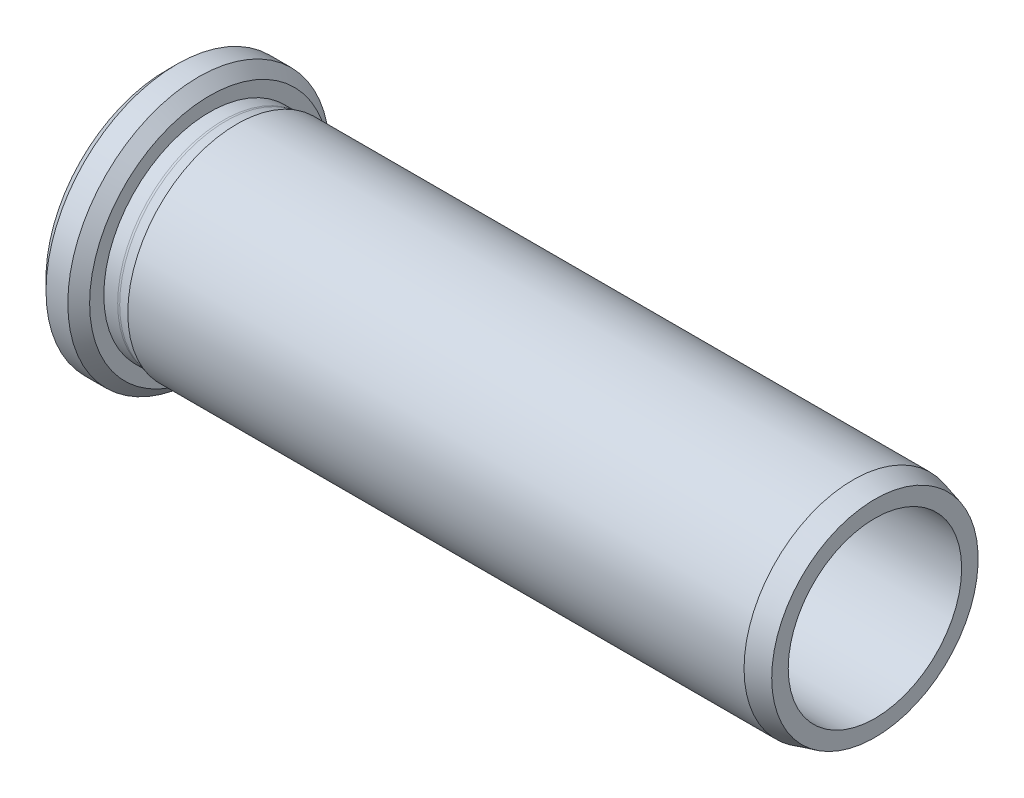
ISO-10303-21;
HEADER;
FILE_DESCRIPTION(('STEP AP214'),'2;1');
FILE_NAME('part.step','',(''),(''),'','','');
FILE_SCHEMA(('AUTOMOTIVE_DESIGN { 1 0 10303 214 1 1 1 1 }'));
ENDSEC;
DATA;
#1=APPLICATION_CONTEXT('core data for automotive mechanical design processes');
#2=APPLICATION_PROTOCOL_DEFINITION('international standard','automotive_design',2000,#1);
#3=PRODUCT_CONTEXT('',#1,'mechanical');
#4=PRODUCT('Part','Part','',(#3));
#5=PRODUCT_RELATED_PRODUCT_CATEGORY('part','',(#4));
#6=PRODUCT_DEFINITION_FORMATION('','',#4);
#7=PRODUCT_DEFINITION_CONTEXT('part definition',#1,'design');
#8=PRODUCT_DEFINITION('design','',#6,#7);
#9=PRODUCT_DEFINITION_SHAPE('','',#8);
#10=(LENGTH_UNIT() NAMED_UNIT(*) SI_UNIT(.MILLI.,.METRE.));
#11=(NAMED_UNIT(*) PLANE_ANGLE_UNIT() SI_UNIT($,.RADIAN.));
#12=(NAMED_UNIT(*) SI_UNIT($,.STERADIAN.) SOLID_ANGLE_UNIT());
#13=UNCERTAINTY_MEASURE_WITH_UNIT(LENGTH_MEASURE(1.E-05),#10,'distance_accuracy_value','');
#14=(GEOMETRIC_REPRESENTATION_CONTEXT(3) GLOBAL_UNCERTAINTY_ASSIGNED_CONTEXT((#13)) GLOBAL_UNIT_ASSIGNED_CONTEXT((#10,
#11,#12)) REPRESENTATION_CONTEXT('',''));
#15=CARTESIAN_POINT('',(0.,0.,0.));
#16=DIRECTION('',(0.,0.,1.));
#17=DIRECTION('',(1.,0.,0.));
#18=AXIS2_PLACEMENT_3D('',#15,#16,#17);
#19=CARTESIAN_POINT('',(30.8004766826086,7.95,0.));
#20=DIRECTION('',(1.,0.,0.));
#21=DIRECTION('',(0.,0.,-1.));
#22=AXIS2_PLACEMENT_3D('',#19,#20,#21);
#23=PLANE('',#22);
#24=CARTESIAN_POINT('',(30.8004766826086,0.,0.));
#25=DIRECTION('',(-1.,0.,0.));
#26=DIRECTION('',(0.,0.,1.));
#27=AXIS2_PLACEMENT_3D('',#24,#25,#26);
#28=CIRCLE('',#27,7.95);
#29=CARTESIAN_POINT('',(30.8004766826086,0.,7.95));
#30=VERTEX_POINT('',#29);
#31=EDGE_CURVE('E64',#30,#30,#28,.T.);
#32=ORIENTED_EDGE('',*,*,#31,.F.);
#33=EDGE_LOOP('',(#32));
#34=FACE_BOUND('',#33,.T.);
#35=CARTESIAN_POINT('',(30.8004766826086,0.,0.));
#36=DIRECTION('',(-1.,0.,0.));
#37=DIRECTION('',(0.,0.,1.));
#38=AXIS2_PLACEMENT_3D('',#35,#36,#37);
#39=CIRCLE('',#38,8.);
#40=CARTESIAN_POINT('',(30.8004766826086,0.,8.));
#41=VERTEX_POINT('',#40);
#42=EDGE_CURVE('E40',#41,#41,#39,.T.);
#43=ORIENTED_EDGE('',*,*,#42,.T.);
#44=EDGE_LOOP('',(#43));
#45=FACE_BOUND('',#44,.T.);
#46=ADVANCED_FACE('F14',(#34,#45),#23,.F.);
#47=CARTESIAN_POINT('',(0.,0.,0.));
#48=DIRECTION('',(-1.,0.,0.));
#49=DIRECTION('',(0.,0.,1.));
#50=AXIS2_PLACEMENT_3D('',#47,#48,#49);
#51=CYLINDRICAL_SURFACE('',#50,8.);
#52=CARTESIAN_POINT('',(12.3004766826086,0.,0.));
#53=DIRECTION('',(1.,0.,0.));
#54=DIRECTION('',(0.,0.,-1.));
#55=AXIS2_PLACEMENT_3D('',#52,#53,#54);
#56=CIRCLE('',#55,8.);
#57=CARTESIAN_POINT('',(12.3004766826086,0.,-8.));
#58=VERTEX_POINT('',#57);
#59=EDGE_CURVE('E29',#58,#58,#56,.F.);
#60=ORIENTED_EDGE('',*,*,#59,.T.);
#61=EDGE_LOOP('',(#60));
#62=FACE_BOUND('',#61,.T.);
#63=ORIENTED_EDGE('',*,*,#42,.F.);
#64=EDGE_LOOP('',(#63));
#65=FACE_BOUND('',#64,.T.);
#66=ADVANCED_FACE('F72',(#62,#65),#51,.F.);
#67=CARTESIAN_POINT('',(10.8004766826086,12.,0.));
#68=DIRECTION('',(1.,0.,0.));
#69=DIRECTION('',(0.,0.,-1.));
#70=AXIS2_PLACEMENT_3D('',#67,#68,#69);
#71=PLANE('',#70);
#72=CARTESIAN_POINT('',(10.8004766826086,0.,0.));
#73=DIRECTION('',(1.,0.,0.));
#74=DIRECTION('',(0.,0.,-1.));
#75=AXIS2_PLACEMENT_3D('',#72,#73,#74);
#76=CIRCLE('',#75,9.5);
#77=CARTESIAN_POINT('',(10.8004766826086,0.,-9.5));
#78=VERTEX_POINT('',#77);
#79=EDGE_CURVE('E25',#78,#78,#76,.T.);
#80=ORIENTED_EDGE('',*,*,#79,.T.);
#81=EDGE_LOOP('',(#80));
#82=FACE_BOUND('',#81,.T.);
#83=CARTESIAN_POINT('',(10.8004766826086,0.,0.));
#84=DIRECTION('',(1.,0.,0.));
#85=DIRECTION('',(0.,0.,-1.));
#86=AXIS2_PLACEMENT_3D('',#83,#84,#85);
#87=CIRCLE('',#86,11.);
#88=CARTESIAN_POINT('',(10.8004766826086,0.,-11.));
#89=VERTEX_POINT('',#88);
#90=EDGE_CURVE('E37',#89,#89,#87,.F.);
#91=ORIENTED_EDGE('',*,*,#90,.T.);
#92=EDGE_LOOP('',(#91));
#93=FACE_BOUND('',#92,.T.);
#94=ADVANCED_FACE('F77',(#82,#93),#71,.F.);
#95=CARTESIAN_POINT('',(0.,0.,0.));
#96=DIRECTION('',(-1.,0.,0.));
#97=DIRECTION('',(0.,0.,1.));
#98=AXIS2_PLACEMENT_3D('',#95,#96,#97);
#99=CYLINDRICAL_SURFACE('',#98,12.);
#100=CARTESIAN_POINT('',(13.8004766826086,0.,0.));
#101=DIRECTION('',(-1.,0.,0.));
#102=DIRECTION('',(0.,0.,1.));
#103=AXIS2_PLACEMENT_3D('',#100,#101,#102);
#104=CIRCLE('',#103,12.);
#105=CARTESIAN_POINT('',(13.8004766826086,0.,12.));
#106=VERTEX_POINT('',#105);
#107=EDGE_CURVE('E21',#106,#106,#104,.T.);
#108=ORIENTED_EDGE('',*,*,#107,.T.);
#109=EDGE_LOOP('',(#108));
#110=FACE_BOUND('',#109,.T.);
#111=CARTESIAN_POINT('',(11.8004766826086,0.,0.));
#112=DIRECTION('',(1.,0.,0.));
#113=DIRECTION('',(0.,0.,-1.));
#114=AXIS2_PLACEMENT_3D('',#111,#112,#113);
#115=CIRCLE('',#114,12.);
#116=CARTESIAN_POINT('',(11.8004766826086,0.,-12.));
#117=VERTEX_POINT('',#116);
#118=EDGE_CURVE('E34',#117,#117,#115,.T.);
#119=ORIENTED_EDGE('',*,*,#118,.T.);
#120=EDGE_LOOP('',(#119));
#121=FACE_BOUND('',#120,.T.);
#122=ADVANCED_FACE('F85',(#110,#121),#99,.T.);
#123=CARTESIAN_POINT('',(14.8004766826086,12.,0.));
#124=DIRECTION('',(-1.,0.,0.));
#125=DIRECTION('',(0.,0.,1.));
#126=AXIS2_PLACEMENT_3D('',#123,#124,#125);
#127=PLANE('',#126);
#128=CARTESIAN_POINT('',(14.8004766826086,0.,0.));
#129=DIRECTION('',(-1.,0.,0.));
#130=DIRECTION('',(0.,0.,1.));
#131=AXIS2_PLACEMENT_3D('',#128,#129,#130);
#132=CIRCLE('',#131,11.);
#133=CARTESIAN_POINT('',(14.8004766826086,0.,11.));
#134=VERTEX_POINT('',#133);
#135=EDGE_CURVE('E9',#134,#134,#132,.F.);
#136=ORIENTED_EDGE('',*,*,#135,.T.);
#137=EDGE_LOOP('',(#136));
#138=FACE_BOUND('',#137,.T.);
#139=CARTESIAN_POINT('',(14.8004766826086,0.,0.));
#140=DIRECTION('',(-1.,0.,0.));
#141=DIRECTION('',(0.,0.,1.));
#142=AXIS2_PLACEMENT_3D('',#139,#140,#141);
#143=CIRCLE('',#142,9.7);
#144=CARTESIAN_POINT('',(14.8004766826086,0.,9.7));
#145=VERTEX_POINT('',#144);
#146=EDGE_CURVE('E43',#145,#145,#143,.T.);
#147=ORIENTED_EDGE('',*,*,#146,.T.);
#148=EDGE_LOOP('',(#147));
#149=FACE_BOUND('',#148,.T.);
#150=ADVANCED_FACE('F124',(#138,#149),#127,.F.);
#151=CARTESIAN_POINT('',(0.,0.,0.));
#152=DIRECTION('',(-1.,0.,0.));
#153=DIRECTION('',(0.,0.,1.));
#154=AXIS2_PLACEMENT_3D('',#151,#152,#153);
#155=CYLINDRICAL_SURFACE('',#154,9.7);
#156=ORIENTED_EDGE('',*,*,#146,.F.);
#157=EDGE_LOOP('',(#156));
#158=FACE_BOUND('',#157,.T.);
#159=CARTESIAN_POINT('',(16.075539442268,0.,0.));
#160=DIRECTION('',(-1.,0.,0.));
#161=DIRECTION('',(0.,0.,1.));
#162=AXIS2_PLACEMENT_3D('',#159,#160,#161);
#163=CIRCLE('',#162,9.7);
#164=CARTESIAN_POINT('',(16.075539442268,0.,9.7));
#165=VERTEX_POINT('',#164);
#166=EDGE_CURVE('E46',#165,#165,#163,.T.);
#167=ORIENTED_EDGE('',*,*,#166,.T.);
#168=EDGE_LOOP('',(#167));
#169=FACE_BOUND('',#168,.T.);
#170=ADVANCED_FACE('F129',(#158,#169),#155,.T.);
#171=CARTESIAN_POINT('',(16.075539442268,0.,0.));
#172=DIRECTION('',(-1.,0.,0.));
#173=DIRECTION('',(0.,0.,1.));
#174=AXIS2_PLACEMENT_3D('',#171,#172,#173);
#175=TOROIDAL_SURFACE('',#174,10.5,0.8);
#176=ORIENTED_EDGE('',*,*,#166,.F.);
#177=EDGE_LOOP('',(#176));
#178=FACE_BOUND('',#177,.T.);
#179=CARTESIAN_POINT('',(16.2825946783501,0.,0.));
#180=DIRECTION('',(-1.,0.,0.));
#181=DIRECTION('',(0.,0.,1.));
#182=AXIS2_PLACEMENT_3D('',#179,#180,#181);
#183=CIRCLE('',#182,9.72725933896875);
#184=CARTESIAN_POINT('',(16.2825946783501,0.,9.72725933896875));
#185=VERTEX_POINT('',#184);
#186=EDGE_CURVE('E49',#185,#185,#183,.T.);
#187=ORIENTED_EDGE('',*,*,#186,.T.);
#188=EDGE_LOOP('',(#187));
#189=FACE_BOUND('',#188,.T.);
#190=ADVANCED_FACE('F189',(#178,#189),#175,.F.);
#191=CARTESIAN_POINT('',(17.3004766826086,0.,0.));
#192=DIRECTION('',(1.,0.,0.));
#193=DIRECTION('',(0.,0.,-1.));
#194=AXIS2_PLACEMENT_3D('',#191,#192,#193);
#195=CONICAL_SURFACE('',#194,10.,0.261799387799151);
#196=ORIENTED_EDGE('',*,*,#186,.F.);
#197=EDGE_LOOP('',(#196));
#198=FACE_BOUND('',#197,.T.);
#199=CARTESIAN_POINT('',(17.3004766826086,0.,0.));
#200=DIRECTION('',(-1.,0.,0.));
#201=DIRECTION('',(0.,0.,1.));
#202=AXIS2_PLACEMENT_3D('',#199,#200,#201);
#203=CIRCLE('',#202,10.);
#204=CARTESIAN_POINT('',(17.3004766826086,0.,10.));
#205=VERTEX_POINT('',#204);
#206=EDGE_CURVE('E52',#205,#205,#203,.T.);
#207=ORIENTED_EDGE('',*,*,#206,.T.);
#208=EDGE_LOOP('',(#207));
#209=FACE_BOUND('',#208,.T.);
#210=ADVANCED_FACE('F179',(#198,#209),#195,.T.);
#211=CARTESIAN_POINT('',(0.,0.,0.));
#212=DIRECTION('',(-1.,0.,0.));
#213=DIRECTION('',(0.,0.,1.));
#214=AXIS2_PLACEMENT_3D('',#211,#212,#213);
#215=CYLINDRICAL_SURFACE('',#214,10.);
#216=ORIENTED_EDGE('',*,*,#206,.F.);
#217=EDGE_LOOP('',(#216));
#218=FACE_BOUND('',#217,.T.);
#219=CARTESIAN_POINT('',(73.8004766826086,0.,0.));
#220=DIRECTION('',(-1.,0.,0.));
#221=DIRECTION('',(0.,0.,1.));
#222=AXIS2_PLACEMENT_3D('',#219,#220,#221);
#223=CIRCLE('',#222,10.);
#224=CARTESIAN_POINT('',(73.8004766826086,0.,10.));
#225=VERTEX_POINT('',#224);
#226=EDGE_CURVE('E55',#225,#225,#223,.T.);
#227=ORIENTED_EDGE('',*,*,#226,.T.);
#228=EDGE_LOOP('',(#227));
#229=FACE_BOUND('',#228,.T.);
#230=ADVANCED_FACE('F169',(#218,#229),#215,.T.);
#231=CARTESIAN_POINT('',(75.8004766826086,0.,0.));
#232=DIRECTION('',(-1.,0.,0.));
#233=DIRECTION('',(0.,0.,1.));
#234=AXIS2_PLACEMENT_3D('',#231,#232,#233);
#235=CONICAL_SURFACE('',#234,9.46410161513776,0.261799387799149);
#236=ORIENTED_EDGE('',*,*,#226,.F.);
#237=EDGE_LOOP('',(#236));
#238=FACE_BOUND('',#237,.T.);
#239=CARTESIAN_POINT('',(75.8004766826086,0.,0.));
#240=DIRECTION('',(-1.,0.,0.));
#241=DIRECTION('',(0.,0.,1.));
#242=AXIS2_PLACEMENT_3D('',#239,#240,#241);
#243=CIRCLE('',#242,9.46410161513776);
#244=CARTESIAN_POINT('',(75.8004766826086,0.,9.46410161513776));
#245=VERTEX_POINT('',#244);
#246=EDGE_CURVE('E58',#245,#245,#243,.T.);
#247=ORIENTED_EDGE('',*,*,#246,.T.);
#248=EDGE_LOOP('',(#247));
#249=FACE_BOUND('',#248,.T.);
#250=ADVANCED_FACE('F159',(#238,#249),#235,.T.);
#251=CARTESIAN_POINT('',(75.8004766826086,9.46410161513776,0.));
#252=DIRECTION('',(-1.,0.,0.));
#253=DIRECTION('',(0.,0.,1.));
#254=AXIS2_PLACEMENT_3D('',#251,#252,#253);
#255=PLANE('',#254);
#256=ORIENTED_EDGE('',*,*,#246,.F.);
#257=EDGE_LOOP('',(#256));
#258=FACE_BOUND('',#257,.T.);
#259=CARTESIAN_POINT('',(75.8004766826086,0.,0.));
#260=DIRECTION('',(-1.,0.,0.));
#261=DIRECTION('',(0.,0.,1.));
#262=AXIS2_PLACEMENT_3D('',#259,#260,#261);
#263=CIRCLE('',#262,7.95);
#264=CARTESIAN_POINT('',(75.8004766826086,0.,7.95));
#265=VERTEX_POINT('',#264);
#266=EDGE_CURVE('E61',#265,#265,#263,.T.);
#267=ORIENTED_EDGE('',*,*,#266,.T.);
#268=EDGE_LOOP('',(#267));
#269=FACE_BOUND('',#268,.T.);
#270=ADVANCED_FACE('F148',(#258,#269),#255,.F.);
#271=CARTESIAN_POINT('',(0.,0.,0.));
#272=DIRECTION('',(-1.,0.,0.));
#273=DIRECTION('',(0.,0.,1.));
#274=AXIS2_PLACEMENT_3D('',#271,#272,#273);
#275=CYLINDRICAL_SURFACE('',#274,7.95);
#276=ORIENTED_EDGE('',*,*,#266,.F.);
#277=EDGE_LOOP('',(#276));
#278=FACE_BOUND('',#277,.T.);
#279=ORIENTED_EDGE('',*,*,#31,.T.);
#280=EDGE_LOOP('',(#279));
#281=FACE_BOUND('',#280,.T.);
#282=ADVANCED_FACE('F68',(#278,#281),#275,.F.);
#283=CARTESIAN_POINT('',(10.8004766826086,0.,0.));
#284=DIRECTION('',(1.,0.,0.));
#285=DIRECTION('',(0.,0.,-1.));
#286=AXIS2_PLACEMENT_3D('',#283,#284,#285);
#287=CONICAL_SURFACE('',#286,11.,0.785398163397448);
#288=ORIENTED_EDGE('',*,*,#118,.F.);
#289=EDGE_LOOP('',(#288));
#290=FACE_BOUND('',#289,.T.);
#291=ORIENTED_EDGE('',*,*,#90,.F.);
#292=EDGE_LOOP('',(#291));
#293=FACE_BOUND('',#292,.T.);
#294=ADVANCED_FACE('F90',(#290,#293),#287,.T.);
#295=CARTESIAN_POINT('',(12.3004766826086,0.,0.));
#296=DIRECTION('',(1.,0.,0.));
#297=DIRECTION('',(0.,0.,-1.));
#298=AXIS2_PLACEMENT_3D('',#295,#296,#297);
#299=TOROIDAL_SURFACE('',#298,9.5,1.5);
#300=ORIENTED_EDGE('',*,*,#79,.F.);
#301=EDGE_LOOP('',(#300));
#302=FACE_BOUND('',#301,.T.);
#303=ORIENTED_EDGE('',*,*,#59,.F.);
#304=EDGE_LOOP('',(#303));
#305=FACE_BOUND('',#304,.T.);
#306=ADVANCED_FACE('F92',(#302,#305),#299,.T.);
#307=CARTESIAN_POINT('',(13.8004766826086,0.,0.));
#308=DIRECTION('',(-1.,0.,0.));
#309=DIRECTION('',(0.,0.,1.));
#310=AXIS2_PLACEMENT_3D('',#307,#308,#309);
#311=CONICAL_SURFACE('',#310,12.,0.785398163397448);
#312=ORIENTED_EDGE('',*,*,#135,.F.);
#313=EDGE_LOOP('',(#312));
#314=FACE_BOUND('',#313,.T.);
#315=ORIENTED_EDGE('',*,*,#107,.F.);
#316=EDGE_LOOP('',(#315));
#317=FACE_BOUND('',#316,.T.);
#318=ADVANCED_FACE('F16',(#314,#317),#311,.T.);
#319=CLOSED_SHELL('',(#46,#66,#94,#122,#150,#170,#190,#210,#230,#250,#270,#282,#294,#306,#318));
#320=MANIFOLD_SOLID_BREP('B1',#319);
#321=ADVANCED_BREP_SHAPE_REPRESENTATION('',(#18,#320),#14);
#322=SHAPE_DEFINITION_REPRESENTATION(#9,#321);
ENDSEC;
END-ISO-10303-21;
